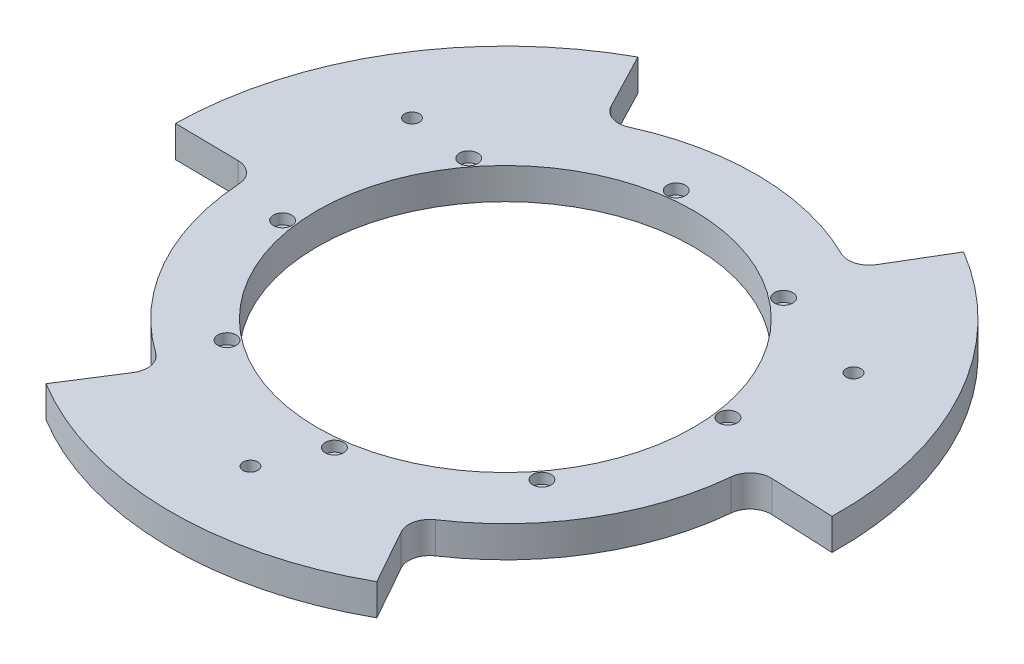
from build123d import *

# Parameters (mm, degrees)
SKETCH1_R           = 101.6
SKETCH1_R_2         = 57.15
BOSS_EXTRUDE1_DEPTH = 9.525
CUT_EXTRUDE5_DEPTH  = 144.999463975
SKETCH7_R           = 2.2479
CUT_EXTRUDE6_DEPTH  = 144.999463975
SKETCH8_R           = 1.4732
CUT_EXTRUDE7_DEPTH  = 144.999463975
SKETCH9_R           = 2.778125
CUT_EXTRUDE8_DEPTH  = 3.175


with BuildPart() as part:
    # Sketch1 → Boss-Extrude1 (new body)
    with BuildSketch(Plane(origin=(0, 0, 0), x_dir=(1, 0, 0), z_dir=(0, 1, 0))):
        with Locations(Location((0, 0, 0), (0, 0, 90))):
            Circle(SKETCH1_R)
        with Locations(Location((0, 0, 0), (0, 0, 90))):
            Circle(SKETCH1_R_2, mode=Mode.SUBTRACT)
    extrude(amount=BOSS_EXTRUDE1_DEPTH)

    # Sketch6 → Cut-Extrude5 (cut, through all)
    with BuildSketch(Plane(origin=(0, 9.525, 0), x_dir=(1, 0, 0), z_dir=(0, 1, 0))):
        with BuildLine():
            Line((49.616347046, -88.661029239), (40.193834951, -71.823642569))
            ThreePointArc((40.193834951, -71.823642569), (39.562206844, -67.233566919), (42.217060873, -63.436265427))
            ThreePointArc((42.217060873, -63.436265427), (65.392573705, -39.118426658), (75.859264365, -7.198055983))
            ThreePointArc((75.859264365, -7.198055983), (78.011761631, -3.008213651), (82.458369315, -1.453960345))
            Line((82.458369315, -1.453960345), (101.574186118, -2.29013417))
            ThreePointArc((101.574186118, -2.29013417), (87.061054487, -52.373015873), (49.616347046, -88.661029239))
        make_face()
        with BuildLine():
            Line((-101.59087717, 1.361497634), (-82.298016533, 1.102939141))
            ThreePointArc((-82.298016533, 1.102939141), (-78.007080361, -0.645092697), (-76.045947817, -4.842914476))
            ThreePointArc((-76.045947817, -4.842914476), (-66.573838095, -37.072416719), (-44.163331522, -62.097022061))
            ThreePointArc((-44.163331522, -62.097022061), (-41.611070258, -66.056060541), (-42.488351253, -70.684062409))
            Line((-42.488351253, -70.684062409), (-52.770407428, -86.820758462))
            ThreePointArc((-52.770407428, -86.820758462), (-88.886889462, -49.21057693), (-101.59087717, 1.361497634))
        make_face()
        with BuildLine():
            Line((51.974530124, 87.299531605), (42.104181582, 70.720703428))
            ThreePointArc((42.104181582, 70.720703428), (38.444873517, 67.878659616), (33.828886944, 68.279179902))
            ThreePointArc((33.828886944, 68.279179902), (1.181264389, 76.190843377), (-31.695932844, 69.295078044))
            ThreePointArc((-31.695932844, 69.295078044), (-36.400691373, 69.064274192), (-39.970018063, 72.138022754))
            Line((-39.970018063, 72.138022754), (-48.80377869, 89.110892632))
            ThreePointArc((-48.80377869, 89.110892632), (1.825834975, 101.583592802), (51.974530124, 87.299531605))
        make_face()
    extrude(amount=-CUT_EXTRUDE5_DEPTH, mode=Mode.SUBTRACT)

    # Sketch7 → Cut-Extrude6 (cut, through all)
    with BuildSketch(Plane(origin=(0, 9.525, 0), x_dir=(1, 0, 0), z_dir=(0, 1, 0))):
        with Locations(Location((0, -77.47, 0), (0, 0, 270))):
            Circle(SKETCH7_R)
        with Locations(Location((-67.090988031, 38.735, 0), (0, 0, 270))):
            Circle(SKETCH7_R)
        with Locations(Location((67.090988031, 38.735, 0), (0, 0, 270))):
            Circle(SKETCH7_R)
    extrude(amount=-CUT_EXTRUDE6_DEPTH, mode=Mode.SUBTRACT)

    # Sketch8 → Cut-Extrude7 (cut, through all)
    with BuildSketch(Plane.XZ):
        with Locations(Location((-59.808911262, 7.873992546, 0), (0, 0, 270))):
            Circle(SKETCH8_R)
        with Locations(Location((-36.723533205, 47.859040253, 0), (0, 0, 270))):
            Circle(SKETCH8_R)
        with Locations(Location((-47.859040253, -36.723533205, 0), (0, 0, 270))):
            Circle(SKETCH8_R)
        with Locations(Location((-7.873992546, -59.808911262, 0), (0, 0, 270))):
            Circle(SKETCH8_R)
        with Locations(Location((36.723533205, -47.859040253, 0), (0, 0, 270))):
            Circle(SKETCH8_R)
        with Locations(Location((59.808911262, -7.873992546, 0), (0, 0, 270))):
            Circle(SKETCH8_R)
        with Locations(Location((7.873992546, 59.808911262, 0), (0, 0, 270))):
            Circle(SKETCH8_R)
        with Locations(Location((47.859040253, 36.723533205, 0), (0, 0, 270))):
            Circle(SKETCH8_R)
    extrude(amount=-CUT_EXTRUDE7_DEPTH, mode=Mode.SUBTRACT)

    # Sketch9 → Cut-Extrude8 (cut)
    with BuildSketch(Plane(origin=(0, 9.525, 0), x_dir=(1, 0, 0), z_dir=(0, 1, 0))):
        with Locations(Location((-36.723533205, -47.859040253, 0), (0, 0, 270))):
            Circle(SKETCH9_R)
        with Locations(Location((-59.808911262, -7.873992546, 0), (0, 0, 270))):
            Circle(SKETCH9_R)
        with Locations(Location((-47.859040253, 36.723533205, 0), (0, 0, 270))):
            Circle(SKETCH9_R)
        with Locations(Location((-7.873992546, 59.808911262, 0), (0, 0, 270))):
            Circle(SKETCH9_R)
        with Locations(Location((36.723533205, 47.859040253, 0), (0, 0, 270))):
            Circle(SKETCH9_R)
        with Locations(Location((59.808911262, 7.873992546, 0), (0, 0, 270))):
            Circle(SKETCH9_R)
        with Locations(Location((47.859040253, -36.723533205, 0), (0, 0, 270))):
            Circle(SKETCH9_R)
        with Locations(Location((7.873992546, -59.808911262, 0), (0, 0, 270))):
            Circle(SKETCH9_R)
    extrude(amount=-CUT_EXTRUDE8_DEPTH, mode=Mode.SUBTRACT)


solid = part.part
